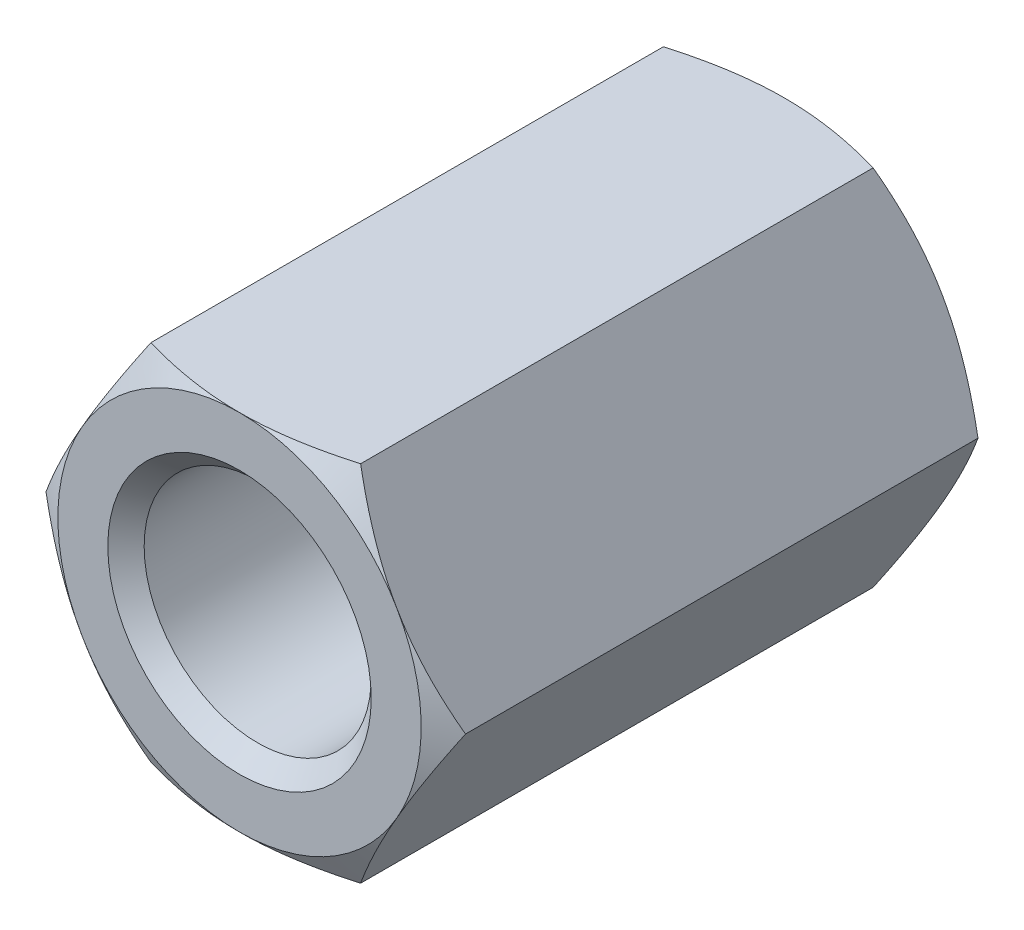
ISO-10303-21;
HEADER;
FILE_DESCRIPTION(('STEP AP214'),'2;1');
FILE_NAME('part.step','',(''),(''),'','','');
FILE_SCHEMA(('AUTOMOTIVE_DESIGN { 1 0 10303 214 1 1 1 1 }'));
ENDSEC;
DATA;
#1=APPLICATION_CONTEXT('core data for automotive mechanical design processes');
#2=APPLICATION_PROTOCOL_DEFINITION('international standard','automotive_design',2000,#1);
#3=PRODUCT_CONTEXT('',#1,'mechanical');
#4=PRODUCT('Part','Part','',(#3));
#5=PRODUCT_RELATED_PRODUCT_CATEGORY('part','',(#4));
#6=PRODUCT_DEFINITION_FORMATION('','',#4);
#7=PRODUCT_DEFINITION_CONTEXT('part definition',#1,'design');
#8=PRODUCT_DEFINITION('design','',#6,#7);
#9=PRODUCT_DEFINITION_SHAPE('','',#8);
#10=(LENGTH_UNIT() NAMED_UNIT(*) SI_UNIT(.MILLI.,.METRE.));
#11=(NAMED_UNIT(*) PLANE_ANGLE_UNIT() SI_UNIT($,.RADIAN.));
#12=(NAMED_UNIT(*) SI_UNIT($,.STERADIAN.) SOLID_ANGLE_UNIT());
#13=UNCERTAINTY_MEASURE_WITH_UNIT(LENGTH_MEASURE(1.E-05),#10,'distance_accuracy_value','');
#14=(GEOMETRIC_REPRESENTATION_CONTEXT(3) GLOBAL_UNCERTAINTY_ASSIGNED_CONTEXT((#13)) GLOBAL_UNIT_ASSIGNED_CONTEXT((#10,
#11,#12)) REPRESENTATION_CONTEXT('',''));
#15=CARTESIAN_POINT('',(0.,0.,0.));
#16=DIRECTION('',(0.,0.,1.));
#17=DIRECTION('',(1.,0.,0.));
#18=AXIS2_PLACEMENT_3D('',#15,#16,#17);
#19=CARTESIAN_POINT('',(4.61880215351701,0.,-6.));
#20=DIRECTION('',(0.866025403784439,0.5,0.));
#21=DIRECTION('',(-0.5,0.866025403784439,0.));
#22=AXIS2_PLACEMENT_3D('',#19,#20,#21);
#23=PLANE('',#22);
#24=CARTESIAN_POINT('',(4.61891762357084,-0.000199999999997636,5.64266774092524));
#25=CARTESIAN_POINT('',(4.5174314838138,0.17557915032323,5.70128212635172));
#26=CARTESIAN_POINT('',(4.41506932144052,0.352875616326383,5.75458967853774));
#27=CARTESIAN_POINT('',(4.20857250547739,0.710538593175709,5.8476383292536));
#28=CARTESIAN_POINT('',(4.10443418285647,0.890911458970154,5.8873465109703));
#29=CARTESIAN_POINT('',(3.89744813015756,1.24942181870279,5.94915778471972));
#30=CARTESIAN_POINT('',(3.79463224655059,1.42750415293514,5.97167226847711));
#31=CARTESIAN_POINT('',(3.58851671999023,1.78450671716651,5.99854937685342));
#32=CARTESIAN_POINT('',(3.48521782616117,1.9634256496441,6.00293425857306));
#33=CARTESIAN_POINT('',(3.29219970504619,2.29774284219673,5.99380992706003));
#34=CARTESIAN_POINT('',(3.20245157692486,2.45319115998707,5.98254104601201));
#35=CARTESIAN_POINT('',(3.02354002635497,2.76307505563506,5.94682600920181));
#36=CARTESIAN_POINT('',(2.93437722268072,2.91750956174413,5.92236765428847));
#37=CARTESIAN_POINT('',(2.75509682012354,3.22803232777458,5.86122393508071));
#38=CARTESIAN_POINT('',(2.6650019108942,3.3840812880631,5.82427939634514));
#39=CARTESIAN_POINT('',(2.48615580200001,3.69385183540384,5.74042992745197));
#40=CARTESIAN_POINT('',(2.39740231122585,3.84757739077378,5.69354469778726));
#41=CARTESIAN_POINT('',(2.30928560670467,4.0002,5.64266774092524));
#42=B_SPLINE_CURVE_WITH_KNOTS('',3,(#24,#25,#26,#27,#28,#29,#30,#31,#32,#33,#34,#35,#36,#37,#38,
#39,#40,#41),.UNSPECIFIED.,.F.,.F.,(4,2,2,2,2,2,2,2,4),(0.,0.634047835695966,1.26961969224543,
1.88946157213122,2.50854226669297,3.04757825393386,3.58711366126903,4.13861653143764,
4.68903648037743),.UNSPECIFIED.);
#43=CARTESIAN_POINT('',(4.61880215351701,0.,5.64273441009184));
#44=VERTEX_POINT('',#43);
#45=CARTESIAN_POINT('',(3.46410161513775,2.,6.));
#46=VERTEX_POINT('',#45);
#47=EDGE_CURVE('E127',#44,#46,#42,.T.);
#48=ORIENTED_EDGE('',*,*,#47,.F.);
#49=DIRECTION('',(0.,0.,1.));
#50=VECTOR('',#49,1.);
#51=CARTESIAN_POINT('',(4.61880215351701,0.,-6.));
#52=LINE('',#51,#50);
#53=CARTESIAN_POINT('',(4.61880215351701,0.,-5.64273441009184));
#54=VERTEX_POINT('',#53);
#55=EDGE_CURVE('E595',#54,#44,#52,.T.);
#56=ORIENTED_EDGE('',*,*,#55,.F.);
#57=CARTESIAN_POINT('',(4.61891762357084,-0.000199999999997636,-5.64266774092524));
#58=CARTESIAN_POINT('',(4.5174314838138,0.17557915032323,-5.70128212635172));
#59=CARTESIAN_POINT('',(4.41506932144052,0.352875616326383,-5.75458967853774));
#60=CARTESIAN_POINT('',(4.20857250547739,0.710538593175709,-5.8476383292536));
#61=CARTESIAN_POINT('',(4.10443418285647,0.890911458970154,-5.8873465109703));
#62=CARTESIAN_POINT('',(3.89744813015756,1.24942181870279,-5.94915778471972));
#63=CARTESIAN_POINT('',(3.79463224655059,1.42750415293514,-5.97167226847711));
#64=CARTESIAN_POINT('',(3.58851671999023,1.78450671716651,-5.99854937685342));
#65=CARTESIAN_POINT('',(3.48521782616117,1.9634256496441,-6.00293425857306));
#66=CARTESIAN_POINT('',(3.29219970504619,2.29774284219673,-5.99380992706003));
#67=CARTESIAN_POINT('',(3.20245157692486,2.45319115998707,-5.98254104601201));
#68=CARTESIAN_POINT('',(3.02354002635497,2.76307505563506,-5.94682600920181));
#69=CARTESIAN_POINT('',(2.93437722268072,2.91750956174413,-5.92236765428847));
#70=CARTESIAN_POINT('',(2.75509682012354,3.22803232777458,-5.86122393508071));
#71=CARTESIAN_POINT('',(2.6650019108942,3.3840812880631,-5.82427939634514));
#72=CARTESIAN_POINT('',(2.48615580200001,3.69385183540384,-5.74042992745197));
#73=CARTESIAN_POINT('',(2.39740231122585,3.84757739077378,-5.69354469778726));
#74=CARTESIAN_POINT('',(2.30928560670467,4.0002,-5.64266774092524));
#75=B_SPLINE_CURVE_WITH_KNOTS('',3,(#57,#58,#59,#60,#61,#62,#63,#64,#65,#66,#67,#68,#69,#70,#71,
#72,#73,#74),.UNSPECIFIED.,.F.,.F.,(4,2,2,2,2,2,2,2,4),(0.,0.634047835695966,1.26961969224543,
1.88946157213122,2.50854226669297,3.04757825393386,3.58711366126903,4.13861653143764,
4.68903648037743),.UNSPECIFIED.);
#76=CARTESIAN_POINT('',(3.46410161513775,2.,-6.));
#77=VERTEX_POINT('',#76);
#78=EDGE_CURVE('E627',#54,#77,#75,.T.);
#79=ORIENTED_EDGE('',*,*,#78,.T.);
#80=CARTESIAN_POINT('',(2.3094010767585,4.,-5.64273441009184));
#81=VERTEX_POINT('',#80);
#82=EDGE_CURVE('E268',#77,#81,#75,.T.);
#83=ORIENTED_EDGE('',*,*,#82,.T.);
#84=DIRECTION('',(0.,0.,1.));
#85=VECTOR('',#84,1.);
#86=CARTESIAN_POINT('',(2.3094010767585,4.,-6.));
#87=LINE('',#86,#85);
#88=CARTESIAN_POINT('',(2.3094010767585,4.,5.64273441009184));
#89=VERTEX_POINT('',#88);
#90=EDGE_CURVE('E159',#81,#89,#87,.T.);
#91=ORIENTED_EDGE('',*,*,#90,.T.);
#92=EDGE_CURVE('E140',#46,#89,#42,.T.);
#93=ORIENTED_EDGE('',*,*,#92,.F.);
#94=EDGE_LOOP('',(#48,#56,#79,#83,#91,#93));
#95=FACE_BOUND('',#94,.T.);
#96=ADVANCED_FACE('F41',(#95),#23,.T.);
#97=CARTESIAN_POINT('',(2.3094010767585,-4.,-6.));
#98=DIRECTION('',(0.866025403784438,-0.5,0.));
#99=DIRECTION('',(0.5,0.866025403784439,0.));
#100=AXIS2_PLACEMENT_3D('',#97,#98,#99);
#101=PLANE('',#100);
#102=CARTESIAN_POINT('',(2.30928560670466,-4.0002,5.64266774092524));
#103=CARTESIAN_POINT('',(2.4107717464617,-3.82442084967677,5.70128212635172));
#104=CARTESIAN_POINT('',(2.51313390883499,-3.64712438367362,5.75458967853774));
#105=CARTESIAN_POINT('',(2.71963072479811,-3.28946140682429,5.8476383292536));
#106=CARTESIAN_POINT('',(2.82376904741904,-3.10908854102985,5.8873465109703));
#107=CARTESIAN_POINT('',(3.03075510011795,-2.75057818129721,5.94915778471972));
#108=CARTESIAN_POINT('',(3.13357098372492,-2.57249584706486,5.97167226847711));
#109=CARTESIAN_POINT('',(3.33968651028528,-2.21549328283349,5.99854937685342));
#110=CARTESIAN_POINT('',(3.44298540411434,-2.0365743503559,6.00293425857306));
#111=CARTESIAN_POINT('',(3.63600352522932,-1.70225715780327,5.99380992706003));
#112=CARTESIAN_POINT('',(3.72575165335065,-1.54680884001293,5.98254104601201));
#113=CARTESIAN_POINT('',(3.90466320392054,-1.23692494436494,5.94682600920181));
#114=CARTESIAN_POINT('',(3.99382600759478,-1.08249043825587,5.92236765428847));
#115=CARTESIAN_POINT('',(4.17310641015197,-0.77196767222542,5.86122393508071));
#116=CARTESIAN_POINT('',(4.26320131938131,-0.615918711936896,5.82427939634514));
#117=CARTESIAN_POINT('',(4.4420474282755,-0.306148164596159,5.74042992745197));
#118=CARTESIAN_POINT('',(4.53080091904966,-0.152422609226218,5.69354469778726));
#119=CARTESIAN_POINT('',(4.61891762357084,0.000200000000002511,5.64266774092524));
#120=B_SPLINE_CURVE_WITH_KNOTS('',3,(#102,#103,#104,#105,#106,#107,#108,#109,#110,#111,#112,
#113,#114,#115,#116,#117,#118,#119),.UNSPECIFIED.,.F.,.F.,(4,2,2,2,2,2,2,2,4),(0.,
0.634047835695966,1.26961969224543,1.88946157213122,2.50854226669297,3.04757825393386,
3.58711366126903,4.13861653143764,4.68903648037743),.UNSPECIFIED.);
#121=CARTESIAN_POINT('',(2.3094010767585,-4.,5.64273441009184));
#122=VERTEX_POINT('',#121);
#123=CARTESIAN_POINT('',(3.46410161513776,-2.,6.));
#124=VERTEX_POINT('',#123);
#125=EDGE_CURVE('E534',#122,#124,#120,.T.);
#126=ORIENTED_EDGE('',*,*,#125,.F.);
#127=DIRECTION('',(0.,0.,1.));
#128=VECTOR('',#127,1.);
#129=CARTESIAN_POINT('',(2.3094010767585,-4.,-6.));
#130=LINE('',#129,#128);
#131=CARTESIAN_POINT('',(2.3094010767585,-4.,-5.64273441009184));
#132=VERTEX_POINT('',#131);
#133=EDGE_CURVE('E281',#132,#122,#130,.T.);
#134=ORIENTED_EDGE('',*,*,#133,.F.);
#135=CARTESIAN_POINT('',(2.30928560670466,-4.0002,-5.64266774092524));
#136=CARTESIAN_POINT('',(2.4107717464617,-3.82442084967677,-5.70128212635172));
#137=CARTESIAN_POINT('',(2.51313390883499,-3.64712438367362,-5.75458967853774));
#138=CARTESIAN_POINT('',(2.71963072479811,-3.28946140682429,-5.8476383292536));
#139=CARTESIAN_POINT('',(2.82376904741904,-3.10908854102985,-5.8873465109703));
#140=CARTESIAN_POINT('',(3.03075510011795,-2.75057818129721,-5.94915778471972));
#141=CARTESIAN_POINT('',(3.13357098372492,-2.57249584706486,-5.97167226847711));
#142=CARTESIAN_POINT('',(3.33968651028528,-2.21549328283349,-5.99854937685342));
#143=CARTESIAN_POINT('',(3.44298540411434,-2.0365743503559,-6.00293425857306));
#144=CARTESIAN_POINT('',(3.63600352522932,-1.70225715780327,-5.99380992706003));
#145=CARTESIAN_POINT('',(3.72575165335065,-1.54680884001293,-5.98254104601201));
#146=CARTESIAN_POINT('',(3.90466320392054,-1.23692494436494,-5.94682600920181));
#147=CARTESIAN_POINT('',(3.99382600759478,-1.08249043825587,-5.92236765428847));
#148=CARTESIAN_POINT('',(4.17310641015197,-0.77196767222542,-5.86122393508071));
#149=CARTESIAN_POINT('',(4.26320131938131,-0.615918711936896,-5.82427939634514));
#150=CARTESIAN_POINT('',(4.4420474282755,-0.306148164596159,-5.74042992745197));
#151=CARTESIAN_POINT('',(4.53080091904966,-0.152422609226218,-5.69354469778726));
#152=CARTESIAN_POINT('',(4.61891762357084,0.000200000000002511,-5.64266774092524));
#153=B_SPLINE_CURVE_WITH_KNOTS('',3,(#135,#136,#137,#138,#139,#140,#141,#142,#143,#144,#145,
#146,#147,#148,#149,#150,#151,#152),.UNSPECIFIED.,.F.,.F.,(4,2,2,2,2,2,2,2,4),(0.,
0.634047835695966,1.26961969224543,1.88946157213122,2.50854226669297,3.04757825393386,
3.58711366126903,4.13861653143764,4.68903648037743),.UNSPECIFIED.);
#154=CARTESIAN_POINT('',(3.46410161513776,-2.,-6.));
#155=VERTEX_POINT('',#154);
#156=EDGE_CURVE('E603',#132,#155,#153,.T.);
#157=ORIENTED_EDGE('',*,*,#156,.T.);
#158=EDGE_CURVE('E282',#155,#54,#153,.T.);
#159=ORIENTED_EDGE('',*,*,#158,.T.);
#160=ORIENTED_EDGE('',*,*,#55,.T.);
#161=EDGE_CURVE('E132',#124,#44,#120,.T.);
#162=ORIENTED_EDGE('',*,*,#161,.F.);
#163=EDGE_LOOP('',(#126,#134,#157,#159,#160,#162));
#164=FACE_BOUND('',#163,.T.);
#165=ADVANCED_FACE('F253',(#164),#101,.T.);
#166=CARTESIAN_POINT('',(-2.3094010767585,-4.,-6.));
#167=DIRECTION('',(0.,-1.,0.));
#168=DIRECTION('',(0.,0.,-1.));
#169=AXIS2_PLACEMENT_3D('',#166,#167,#168);
#170=PLANE('',#169);
#171=CARTESIAN_POINT('',(-12.6404258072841,-4.,0.65476490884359));
#172=CARTESIAN_POINT('',(-12.3609594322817,-4.,0.80858632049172));
#173=CARTESIAN_POINT('',(-12.0813045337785,-4.,0.96206660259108));
#174=CARTESIAN_POINT('',(-11.5215169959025,-4.,1.26816156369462));
#175=CARTESIAN_POINT('',(-11.2413843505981,-4.,1.42077623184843));
#176=CARTESIAN_POINT('',(-10.6804015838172,-4.,1.72503196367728));
#177=CARTESIAN_POINT('',(-10.3995511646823,-4.,1.87667247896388));
#178=CARTESIAN_POINT('',(-9.83714580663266,-4.,2.17863886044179));
#179=CARTESIAN_POINT('',(-9.555590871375,-4.,2.32896473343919));
#180=CARTESIAN_POINT('',(-8.9862954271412,-4.,2.6307702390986));
#181=CARTESIAN_POINT('',(-8.69853819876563,-4.,2.78221837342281));
#182=CARTESIAN_POINT('',(-8.12186359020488,-4.,3.08288803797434));
#183=CARTESIAN_POINT('',(-7.83294621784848,-4.,3.23210958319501));
#184=CARTESIAN_POINT('',(-7.25367551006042,-4.,3.52758248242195));
#185=CARTESIAN_POINT('',(-6.96332251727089,-4.,3.6738345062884));
#186=CARTESIAN_POINT('',(-6.38065370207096,-4.,3.96236035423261));
#187=CARTESIAN_POINT('',(-6.08833794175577,-4.,4.10463430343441));
#188=CARTESIAN_POINT('',(-5.49518784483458,-4.,4.38647747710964));
#189=CARTESIAN_POINT('',(-5.19430016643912,-4.,4.52593542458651));
#190=CARTESIAN_POINT('',(-4.74013447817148,-4.,4.72890873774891));
#191=CARTESIAN_POINT('',(-4.5882500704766,-4.,4.79554063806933));
#192=CARTESIAN_POINT('',(-4.28339108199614,-4.,4.92625693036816));
#193=CARTESIAN_POINT('',(-4.13041653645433,-4.,4.9903414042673));
#194=CARTESIAN_POINT('',(-3.82367638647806,-4.,5.11520262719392));
#195=CARTESIAN_POINT('',(-3.66991475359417,-4.,5.17598909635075));
#196=CARTESIAN_POINT('',(-3.36092720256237,-4.,5.2937551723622));
#197=CARTESIAN_POINT('',(-3.2057012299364,-4.,5.35073463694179));
#198=CARTESIAN_POINT('',(-2.89363286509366,-4.,5.45997326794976));
#199=CARTESIAN_POINT('',(-2.73679093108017,-4.,5.5122337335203));
#200=CARTESIAN_POINT('',(-2.42129724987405,-4.,5.61093761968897));
#201=CARTESIAN_POINT('',(-2.26264570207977,-4.,5.65738167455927));
#202=CARTESIAN_POINT('',(-1.88387963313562,-4.,5.75914903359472));
#203=CARTESIAN_POINT('',(-1.66290033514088,-4.,5.81132807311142));
#204=CARTESIAN_POINT('',(-1.21751447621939,-4.,5.89840800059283));
#205=CARTESIAN_POINT('',(-0.993109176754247,-4.,5.93331509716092));
#206=CARTESIAN_POINT('',(-0.655543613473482,-4.,5.97005927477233));
#207=CARTESIAN_POINT('',(-0.543206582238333,-4.,5.97969871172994));
#208=CARTESIAN_POINT('',(-0.318193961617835,-4.,5.99360343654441));
#209=CARTESIAN_POINT('',(-0.205518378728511,-4.,5.99786882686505));
#210=CARTESIAN_POINT('',(0.0198964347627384,-4.,6.00088803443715));
#211=CARTESIAN_POINT('',(0.132635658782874,-4.,5.99964234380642));
#212=CARTESIAN_POINT('',(0.357932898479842,-4.,5.99168182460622));
#213=CARTESIAN_POINT('',(0.470490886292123,-4.,5.9849662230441));
#214=CARTESIAN_POINT('',(0.724775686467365,-4.,5.96379631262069));
#215=CARTESIAN_POINT('',(0.866373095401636,-4.,5.9477691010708));
#216=CARTESIAN_POINT('',(1.14846756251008,-4.,5.90799540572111));
#217=CARTESIAN_POINT('',(1.28896450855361,-4.,5.88424814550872));
#218=CARTESIAN_POINT('',(1.70869612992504,-4.,5.80273394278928));
#219=CARTESIAN_POINT('',(1.98596294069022,-4.,5.73471436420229));
#220=CARTESIAN_POINT('',(2.40036397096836,-4.,5.61701301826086));
#221=CARTESIAN_POINT('',(2.5397017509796,-4.,5.57463667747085));
#222=CARTESIAN_POINT('',(2.81691508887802,-4.,5.48558820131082));
#223=CARTESIAN_POINT('',(2.9547915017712,-4.,5.43891875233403));
#224=CARTESIAN_POINT('',(3.22924871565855,-4.,5.34200840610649));
#225=CARTESIAN_POINT('',(3.36582970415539,-4.,5.29176803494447));
#226=CARTESIAN_POINT('',(3.63788074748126,-4.,5.18830569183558));
#227=CARTESIAN_POINT('',(3.7733506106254,-4.,5.13508321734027));
#228=CARTESIAN_POINT('',(4.10642901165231,-4.,5.00069335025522));
#229=CARTESIAN_POINT('',(4.30346128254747,-4.,4.9181000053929));
#230=CARTESIAN_POINT('',(4.69576438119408,-4.,4.74881840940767));
#231=CARTESIAN_POINT('',(4.8910350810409,-4.,4.66212986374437));
#232=CARTESIAN_POINT('',(5.28015751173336,-4.,4.48554656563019));
#233=CARTESIAN_POINT('',(5.47400899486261,-4.,4.39565126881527));
#234=CARTESIAN_POINT('',(5.86052127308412,-4.,4.21333240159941));
#235=CARTESIAN_POINT('',(6.05318204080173,-4.,4.12090877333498));
#236=CARTESIAN_POINT('',(6.6301600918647,-4.,3.84040917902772));
#237=CARTESIAN_POINT('',(7.01301014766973,-4.,3.64931775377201));
#238=CARTESIAN_POINT('',(7.77595708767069,-4.,3.26186622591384));
#239=CARTESIAN_POINT('',(8.15605430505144,-4.,3.06550677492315));
#240=CARTESIAN_POINT('',(8.88003989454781,-4.,2.6870129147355));
#241=CARTESIAN_POINT('',(9.22409522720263,-4.,2.50519731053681));
#242=CARTESIAN_POINT('',(9.9110102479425,-4.,2.13929537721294));
#243=CARTESIAN_POINT('',(10.2538698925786,-4.,1.95520896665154));
#244=CARTESIAN_POINT('',(10.9377648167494,-4.,1.58580818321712));
#245=CARTESIAN_POINT('',(11.2788025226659,-4.,1.4004982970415));
#246=CARTESIAN_POINT('',(11.9601262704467,-4.,1.02854450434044));
#247=CARTESIAN_POINT('',(12.3004123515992,-4.,0.841900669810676));
#248=CARTESIAN_POINT('',(12.6404258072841,-4.,0.654764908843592));
#249=B_SPLINE_CURVE_WITH_KNOTS('',3,(#171,#172,#173,#174,#175,#176,#177,#178,#179,#180,#181,
#182,#183,#184,#185,#186,#187,#188,#189,#190,#191,#192,#193,#194,#195,#196,#197,#198,#199,#200,
#201,#202,#203,#204,#205,#206,#207,#208,#209,#210,#211,#212,#213,#214,#215,#216,#217,#218,#219,
#220,#221,#222,#223,#224,#225,#226,#227,#228,#229,#230,#231,#232,#233,#234,#235,#236,#237,#238,
#239,#240,#241,#242,#243,#244,#245,#246,#247,#248),.UNSPECIFIED.,.F.,.F.,(4,2,2,2,2,2,2,2,2,2,2,
2,2,2,2,2,2,2,2,2,2,2,2,2,2,2,2,2,2,2,2,2,2,2,2,2,2,2,4),(0.,0.957007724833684,1.91402741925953,
2.87154547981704,3.82905858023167,4.8045852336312,5.78010531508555,6.75540283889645,
7.73066965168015,8.72547348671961,9.22302786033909,9.7205662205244,10.2165481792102,
10.7125486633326,11.2084121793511,11.7042215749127,12.3848621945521,13.0652579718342,
13.4033972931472,13.7415301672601,14.07963284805,14.4177833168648,14.8450390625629,
15.2723377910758,16.1275610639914,16.5644434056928,17.0010542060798,17.4376008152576,
17.8742212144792,18.515085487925,19.1559959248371,19.797015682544,20.438050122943,
21.7216478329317,23.0050874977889,24.172500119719,25.3399547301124,26.5043475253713,
27.6686779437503),.UNSPECIFIED.);
#250=CARTESIAN_POINT('',(-2.3094010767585,-4.,5.64273441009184));
#251=VERTEX_POINT('',#250);
#252=CARTESIAN_POINT('',(0.,-4.,6.));
#253=VERTEX_POINT('',#252);
#254=EDGE_CURVE('E531',#251,#253,#249,.T.);
#255=ORIENTED_EDGE('',*,*,#254,.F.);
#256=DIRECTION('',(0.,0.,1.));
#257=VECTOR('',#256,1.);
#258=CARTESIAN_POINT('',(-2.3094010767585,-4.,-6.));
#259=LINE('',#258,#257);
#260=CARTESIAN_POINT('',(-2.3094010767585,-4.,-5.64273441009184));
#261=VERTEX_POINT('',#260);
#262=EDGE_CURVE('E583',#261,#251,#259,.T.);
#263=ORIENTED_EDGE('',*,*,#262,.F.);
#264=CARTESIAN_POINT('',(-9.20954650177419,-4.,-2.51239763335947));
#265=CARTESIAN_POINT('',(-8.99996160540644,-4.,-2.6233730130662));
#266=CARTESIAN_POINT('',(-8.7901362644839,-4.,-2.73389739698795));
#267=CARTESIAN_POINT('',(-8.36988903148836,-4.,-2.95381045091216));
#268=CARTESIAN_POINT('',(-8.15946713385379,-4.,-3.06319911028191));
#269=CARTESIAN_POINT('',(-7.73766371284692,-4.,-3.28073452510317));
#270=CARTESIAN_POINT('',(-7.52628134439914,-4.,-3.38887964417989));
#271=CARTESIAN_POINT('',(-7.10265211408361,-4.,-3.6034712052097));
#272=CARTESIAN_POINT('',(-6.89040524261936,-4.,-3.70991762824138));
#273=CARTESIAN_POINT('',(-6.45325708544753,-4.,-3.92643335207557));
#274=CARTESIAN_POINT('',(-6.22829678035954,-4.,-4.03638375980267));
#275=CARTESIAN_POINT('',(-5.77692279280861,-4.,-4.25324682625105));
#276=CARTESIAN_POINT('',(-5.55050916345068,-4.,-4.36015959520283));
#277=CARTESIAN_POINT('',(-5.09596404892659,-4.,-4.5699627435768));
#278=CARTESIAN_POINT('',(-4.86783354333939,-4.,-4.67285523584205));
#279=CARTESIAN_POINT('',(-4.40921468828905,-4.,-4.87337963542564));
#280=CARTESIAN_POINT('',(-4.17872594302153,-4.,-4.9710106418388));
#281=CARTESIAN_POINT('',(-3.69446468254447,-4.,-5.16738746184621));
#282=CARTESIAN_POINT('',(-3.44042380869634,-4.,-5.26547932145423));
#283=CARTESIAN_POINT('',(-2.92809810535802,-4.,-5.44970610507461));
#284=CARTESIAN_POINT('',(-2.66981494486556,-4.,-5.53584561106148));
#285=CARTESIAN_POINT('',(-2.15306355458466,-4.,-5.68974681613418));
#286=CARTESIAN_POINT('',(-1.89469451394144,-4.,-5.75783024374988));
#287=CARTESIAN_POINT('',(-1.50352927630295,-4.,-5.84322641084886));
#288=CARTESIAN_POINT('',(-1.37255212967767,-4.,-5.8689019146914));
#289=CARTESIAN_POINT('',(-1.10952089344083,-4.,-5.91390029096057));
#290=CARTESIAN_POINT('',(-0.977467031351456,-4.,-5.93322447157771));
#291=CARTESIAN_POINT('',(-0.733112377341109,-4.,-5.96238395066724));
#292=CARTESIAN_POINT('',(-0.620931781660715,-4.,-5.9732272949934));
#293=CARTESIAN_POINT('',(-0.396193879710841,-4.,-5.98959144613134));
#294=CARTESIAN_POINT('',(-0.283636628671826,-4.,-5.99511300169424));
#295=CARTESIAN_POINT('',(-0.0584081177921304,-4.,-6.00066724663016));
#296=CARTESIAN_POINT('',(0.0542631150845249,-4.,-6.00070102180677));
#297=CARTESIAN_POINT('',(0.279473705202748,-4.,-5.9952816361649));
#298=CARTESIAN_POINT('',(0.392013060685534,-4.,-5.98982840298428));
#299=CARTESIAN_POINT('',(0.618745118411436,-4.,-5.97345272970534));
#300=CARTESIAN_POINT('',(0.732930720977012,-4.,-5.96243274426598));
#301=CARTESIAN_POINT('',(0.960682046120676,-4.,-5.93519991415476));
#302=CARTESIAN_POINT('',(1.07424773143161,-4.,-5.9189867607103));
#303=CARTESIAN_POINT('',(1.30061751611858,-4.,-5.88179418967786));
#304=CARTESIAN_POINT('',(1.41342143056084,-4.,-5.86081365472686));
#305=CARTESIAN_POINT('',(1.63813713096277,-4.,-5.81457504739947));
#306=CARTESIAN_POINT('',(1.75004894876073,-4.,-5.78931712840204));
#307=CARTESIAN_POINT('',(2.02981552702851,-4.,-5.72116797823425));
#308=CARTESIAN_POINT('',(2.1970807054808,-4.,-5.67585504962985));
#309=CARTESIAN_POINT('',(2.52956420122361,-4.,-5.57821125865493));
#310=CARTESIAN_POINT('',(2.69478201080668,-4.,-5.52587869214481));
#311=CARTESIAN_POINT('',(3.02347594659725,-4.,-5.41552751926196));
#312=CARTESIAN_POINT('',(3.18695019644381,-4.,-5.35750336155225));
#313=CARTESIAN_POINT('',(3.51220118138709,-4.,-5.23694186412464));
#314=CARTESIAN_POINT('',(3.67397804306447,-4.,-5.1744048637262));
#315=CARTESIAN_POINT('',(3.99688309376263,-4.,-5.04538407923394));
#316=CARTESIAN_POINT('',(4.15800398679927,-4.,-4.9788821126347));
#317=CARTESIAN_POINT('',(4.47899441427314,-4.,-4.84291723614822));
#318=CARTESIAN_POINT('',(4.63886389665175,-4.,-4.77345420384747));
#319=CARTESIAN_POINT('',(5.1167060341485,-4.,-4.56156399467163));
#320=CARTESIAN_POINT('',(5.43309229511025,-4.,-4.41556228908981));
#321=CARTESIAN_POINT('',(6.04183433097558,-4.,-4.1270656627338));
#322=CARTESIAN_POINT('',(6.3343880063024,-4.,-3.98498406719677));
#323=CARTESIAN_POINT('',(6.91753132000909,-4.,-3.69675358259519));
#324=CARTESIAN_POINT('',(7.20812068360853,-4.,-3.55060413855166));
#325=CARTESIAN_POINT('',(7.78452192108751,-4.,-3.25699130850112));
#326=CARTESIAN_POINT('',(8.07035078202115,-4.,-3.10956115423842));
#327=CARTESIAN_POINT('',(8.64077734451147,-4.,-2.81248443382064));
#328=CARTESIAN_POINT('',(8.92537529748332,-4.,-2.66283835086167));
#329=CARTESIAN_POINT('',(9.20954650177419,-4.,-2.51239763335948));
#330=B_SPLINE_CURVE_WITH_KNOTS('',3,(#264,#265,#266,#267,#268,#269,#270,#271,#272,#273,#274,
#275,#276,#277,#278,#279,#280,#281,#282,#283,#284,#285,#286,#287,#288,#289,#290,#291,#292,#293,
#294,#295,#296,#297,#298,#299,#300,#301,#302,#303,#304,#305,#306,#307,#308,#309,#310,#311,#312,
#313,#314,#315,#316,#317,#318,#319,#320,#321,#322,#323,#324,#325,#326,#327,#328,#329),
.UNSPECIFIED.,.F.,.F.,(4,2,2,2,2,2,2,2,2,2,2,2,2,2,2,2,2,2,2,2,2,2,2,2,2,2,2,2,2,2,2,2,4),(0.,
0.711459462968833,1.42292558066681,2.13524004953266,2.84756244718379,3.5987213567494,
4.34985297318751,5.1005843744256,5.85144391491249,6.66819201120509,7.48462613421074,
8.28535063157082,8.68563323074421,9.0858333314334,9.42382667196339,9.76177245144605,
10.0996513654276,10.437534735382,10.7815555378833,11.1255967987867,11.4697187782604,
11.8138284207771,12.3335061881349,12.8533103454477,13.3736266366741,13.8939038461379,
14.4167843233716,14.9396864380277,15.9849079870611,16.9605651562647,17.9363560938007,
18.9011793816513,19.8657952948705),.UNSPECIFIED.);
#331=CARTESIAN_POINT('',(0.,-4.,-6.));
#332=VERTEX_POINT('',#331);
#333=EDGE_CURVE('E593',#261,#332,#330,.T.);
#334=ORIENTED_EDGE('',*,*,#333,.T.);
#335=EDGE_CURVE('E258',#332,#132,#330,.T.);
#336=ORIENTED_EDGE('',*,*,#335,.T.);
#337=ORIENTED_EDGE('',*,*,#133,.T.);
#338=EDGE_CURVE('E138',#253,#122,#249,.T.);
#339=ORIENTED_EDGE('',*,*,#338,.F.);
#340=EDGE_LOOP('',(#255,#263,#334,#336,#337,#339));
#341=FACE_BOUND('',#340,.T.);
#342=ADVANCED_FACE('F290',(#341),#170,.T.);
#343=CARTESIAN_POINT('',(-4.61880215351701,0.,-6.));
#344=DIRECTION('',(-0.866025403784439,-0.5,0.));
#345=DIRECTION('',(0.5,-0.866025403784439,0.));
#346=AXIS2_PLACEMENT_3D('',#343,#344,#345);
#347=PLANE('',#346);
#348=CARTESIAN_POINT('',(-4.61891762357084,0.000199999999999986,5.64266774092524));
#349=CARTESIAN_POINT('',(-4.5174314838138,-0.175579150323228,5.70128212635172));
#350=CARTESIAN_POINT('',(-4.41506932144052,-0.352875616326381,5.75458967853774));
#351=CARTESIAN_POINT('',(-4.20857250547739,-0.710538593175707,5.8476383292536));
#352=CARTESIAN_POINT('',(-4.10443418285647,-0.890911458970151,5.8873465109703));
#353=CARTESIAN_POINT('',(-3.89744813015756,-1.24942181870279,5.94915778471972));
#354=CARTESIAN_POINT('',(-3.79463224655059,-1.42750415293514,5.97167226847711));
#355=CARTESIAN_POINT('',(-3.58851671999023,-1.78450671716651,5.99854937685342));
#356=CARTESIAN_POINT('',(-3.48521782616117,-1.9634256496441,6.00293425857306));
#357=CARTESIAN_POINT('',(-3.29219970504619,-2.29774284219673,5.99380992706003));
#358=CARTESIAN_POINT('',(-3.20245157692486,-2.45319115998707,5.98254104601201));
#359=CARTESIAN_POINT('',(-3.02354002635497,-2.76307505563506,5.94682600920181));
#360=CARTESIAN_POINT('',(-2.93437722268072,-2.91750956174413,5.92236765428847));
#361=CARTESIAN_POINT('',(-2.75509682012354,-3.22803232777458,5.86122393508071));
#362=CARTESIAN_POINT('',(-2.6650019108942,-3.3840812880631,5.82427939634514));
#363=CARTESIAN_POINT('',(-2.48615580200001,-3.69385183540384,5.74042992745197));
#364=CARTESIAN_POINT('',(-2.39740231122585,-3.84757739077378,5.69354469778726));
#365=CARTESIAN_POINT('',(-2.30928560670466,-4.0002,5.64266774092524));
#366=B_SPLINE_CURVE_WITH_KNOTS('',3,(#348,#349,#350,#351,#352,#353,#354,#355,#356,#357,#358,
#359,#360,#361,#362,#363,#364,#365),.UNSPECIFIED.,.F.,.F.,(4,2,2,2,2,2,2,2,4),(0.,
0.634047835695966,1.26961969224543,1.88946157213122,2.50854226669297,3.04757825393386,
3.58711366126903,4.13861653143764,4.68903648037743),.UNSPECIFIED.);
#367=CARTESIAN_POINT('',(-4.61880215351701,0.,5.64273441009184));
#368=VERTEX_POINT('',#367);
#369=CARTESIAN_POINT('',(-3.46410161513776,-2.,6.));
#370=VERTEX_POINT('',#369);
#371=EDGE_CURVE('E175',#368,#370,#366,.T.);
#372=ORIENTED_EDGE('',*,*,#371,.F.);
#373=DIRECTION('',(0.,0.,1.));
#374=VECTOR('',#373,1.);
#375=CARTESIAN_POINT('',(-4.61880215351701,0.,-6.));
#376=LINE('',#375,#374);
#377=CARTESIAN_POINT('',(-4.61880215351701,0.,-5.64273441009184));
#378=VERTEX_POINT('',#377);
#379=EDGE_CURVE('E526',#378,#368,#376,.T.);
#380=ORIENTED_EDGE('',*,*,#379,.F.);
#381=CARTESIAN_POINT('',(-4.61891762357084,0.000199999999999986,-5.64266774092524));
#382=CARTESIAN_POINT('',(-4.5174314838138,-0.175579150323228,-5.70128212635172));
#383=CARTESIAN_POINT('',(-4.41506932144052,-0.352875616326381,-5.75458967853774));
#384=CARTESIAN_POINT('',(-4.20857250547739,-0.710538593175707,-5.8476383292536));
#385=CARTESIAN_POINT('',(-4.10443418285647,-0.890911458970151,-5.8873465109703));
#386=CARTESIAN_POINT('',(-3.89744813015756,-1.24942181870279,-5.94915778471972));
#387=CARTESIAN_POINT('',(-3.79463224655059,-1.42750415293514,-5.97167226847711));
#388=CARTESIAN_POINT('',(-3.58851671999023,-1.78450671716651,-5.99854937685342));
#389=CARTESIAN_POINT('',(-3.48521782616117,-1.9634256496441,-6.00293425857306));
#390=CARTESIAN_POINT('',(-3.29219970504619,-2.29774284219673,-5.99380992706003));
#391=CARTESIAN_POINT('',(-3.20245157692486,-2.45319115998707,-5.98254104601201));
#392=CARTESIAN_POINT('',(-3.02354002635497,-2.76307505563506,-5.94682600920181));
#393=CARTESIAN_POINT('',(-2.93437722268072,-2.91750956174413,-5.92236765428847));
#394=CARTESIAN_POINT('',(-2.75509682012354,-3.22803232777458,-5.86122393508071));
#395=CARTESIAN_POINT('',(-2.6650019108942,-3.3840812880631,-5.82427939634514));
#396=CARTESIAN_POINT('',(-2.48615580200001,-3.69385183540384,-5.74042992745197));
#397=CARTESIAN_POINT('',(-2.39740231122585,-3.84757739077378,-5.69354469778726));
#398=CARTESIAN_POINT('',(-2.30928560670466,-4.0002,-5.64266774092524));
#399=B_SPLINE_CURVE_WITH_KNOTS('',3,(#381,#382,#383,#384,#385,#386,#387,#388,#389,#390,#391,
#392,#393,#394,#395,#396,#397,#398),.UNSPECIFIED.,.F.,.F.,(4,2,2,2,2,2,2,2,4),(0.,
0.634047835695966,1.26961969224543,1.88946157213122,2.50854226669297,3.04757825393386,
3.58711366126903,4.13861653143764,4.68903648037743),.UNSPECIFIED.);
#400=CARTESIAN_POINT('',(-3.46410161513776,-2.,-6.));
#401=VERTEX_POINT('',#400);
#402=EDGE_CURVE('E274',#378,#401,#399,.T.);
#403=ORIENTED_EDGE('',*,*,#402,.T.);
#404=EDGE_CURVE('E280',#401,#261,#399,.T.);
#405=ORIENTED_EDGE('',*,*,#404,.T.);
#406=ORIENTED_EDGE('',*,*,#262,.T.);
#407=EDGE_CURVE('E533',#370,#251,#366,.T.);
#408=ORIENTED_EDGE('',*,*,#407,.F.);
#409=EDGE_LOOP('',(#372,#380,#403,#405,#406,#408));
#410=FACE_BOUND('',#409,.T.);
#411=ADVANCED_FACE('F287',(#410),#347,.T.);
#412=CARTESIAN_POINT('',(-2.3094010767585,4.,-6.));
#413=DIRECTION('',(-0.866025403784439,0.5,0.));
#414=DIRECTION('',(-0.5,-0.866025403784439,0.));
#415=AXIS2_PLACEMENT_3D('',#412,#413,#414);
#416=PLANE('',#415);
#417=CARTESIAN_POINT('',(-2.30928560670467,4.0002,5.64266774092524));
#418=CARTESIAN_POINT('',(-2.41077174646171,3.82442084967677,5.70128212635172));
#419=CARTESIAN_POINT('',(-2.513133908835,3.64712438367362,5.75458967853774));
#420=CARTESIAN_POINT('',(-2.71963072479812,3.28946140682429,5.8476383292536));
#421=CARTESIAN_POINT('',(-2.82376904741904,3.10908854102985,5.8873465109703));
#422=CARTESIAN_POINT('',(-3.03075510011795,2.75057818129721,5.94915778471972));
#423=CARTESIAN_POINT('',(-3.13357098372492,2.57249584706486,5.97167226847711));
#424=CARTESIAN_POINT('',(-3.33968651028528,2.21549328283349,5.99854937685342));
#425=CARTESIAN_POINT('',(-3.44298540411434,2.0365743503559,6.00293425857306));
#426=CARTESIAN_POINT('',(-3.63600352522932,1.70225715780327,5.99380992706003));
#427=CARTESIAN_POINT('',(-3.72575165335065,1.54680884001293,5.98254104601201));
#428=CARTESIAN_POINT('',(-3.90466320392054,1.23692494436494,5.94682600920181));
#429=CARTESIAN_POINT('',(-3.99382600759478,1.08249043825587,5.92236765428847));
#430=CARTESIAN_POINT('',(-4.17310641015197,0.771967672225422,5.86122393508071));
#431=CARTESIAN_POINT('',(-4.26320131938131,0.615918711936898,5.82427939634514));
#432=CARTESIAN_POINT('',(-4.4420474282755,0.306148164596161,5.74042992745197));
#433=CARTESIAN_POINT('',(-4.53080091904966,0.152422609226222,5.69354469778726));
#434=CARTESIAN_POINT('',(-4.61891762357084,-0.000199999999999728,5.64266774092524));
#435=B_SPLINE_CURVE_WITH_KNOTS('',3,(#417,#418,#419,#420,#421,#422,#423,#424,#425,#426,#427,
#428,#429,#430,#431,#432,#433,#434),.UNSPECIFIED.,.F.,.F.,(4,2,2,2,2,2,2,2,4),(0.,
0.634047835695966,1.26961969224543,1.88946157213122,2.50854226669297,3.04757825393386,
3.58711366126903,4.13861653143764,4.68903648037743),.UNSPECIFIED.);
#436=CARTESIAN_POINT('',(-2.3094010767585,4.,5.64273441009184));
#437=VERTEX_POINT('',#436);
#438=CARTESIAN_POINT('',(-3.46410161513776,2.,6.));
#439=VERTEX_POINT('',#438);
#440=EDGE_CURVE('E182',#437,#439,#435,.T.);
#441=ORIENTED_EDGE('',*,*,#440,.F.);
#442=DIRECTION('',(0.,0.,1.));
#443=VECTOR('',#442,1.);
#444=CARTESIAN_POINT('',(-2.3094010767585,4.,-6.));
#445=LINE('',#444,#443);
#446=CARTESIAN_POINT('',(-2.3094010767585,4.,-5.64273441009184));
#447=VERTEX_POINT('',#446);
#448=EDGE_CURVE('E232',#447,#437,#445,.T.);
#449=ORIENTED_EDGE('',*,*,#448,.F.);
#450=CARTESIAN_POINT('',(-2.30928560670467,4.0002,-5.64266774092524));
#451=CARTESIAN_POINT('',(-2.41077174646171,3.82442084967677,-5.70128212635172));
#452=CARTESIAN_POINT('',(-2.513133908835,3.64712438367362,-5.75458967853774));
#453=CARTESIAN_POINT('',(-2.71963072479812,3.28946140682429,-5.8476383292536));
#454=CARTESIAN_POINT('',(-2.82376904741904,3.10908854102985,-5.8873465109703));
#455=CARTESIAN_POINT('',(-3.03075510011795,2.75057818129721,-5.94915778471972));
#456=CARTESIAN_POINT('',(-3.13357098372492,2.57249584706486,-5.97167226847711));
#457=CARTESIAN_POINT('',(-3.33968651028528,2.21549328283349,-5.99854937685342));
#458=CARTESIAN_POINT('',(-3.44298540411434,2.0365743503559,-6.00293425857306));
#459=CARTESIAN_POINT('',(-3.63600352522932,1.70225715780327,-5.99380992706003));
#460=CARTESIAN_POINT('',(-3.72575165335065,1.54680884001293,-5.98254104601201));
#461=CARTESIAN_POINT('',(-3.90466320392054,1.23692494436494,-5.94682600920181));
#462=CARTESIAN_POINT('',(-3.99382600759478,1.08249043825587,-5.92236765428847));
#463=CARTESIAN_POINT('',(-4.17310641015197,0.771967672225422,-5.86122393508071));
#464=CARTESIAN_POINT('',(-4.26320131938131,0.615918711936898,-5.82427939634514));
#465=CARTESIAN_POINT('',(-4.4420474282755,0.306148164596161,-5.74042992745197));
#466=CARTESIAN_POINT('',(-4.53080091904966,0.152422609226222,-5.69354469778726));
#467=CARTESIAN_POINT('',(-4.61891762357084,-0.000199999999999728,-5.64266774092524));
#468=B_SPLINE_CURVE_WITH_KNOTS('',3,(#450,#451,#452,#453,#454,#455,#456,#457,#458,#459,#460,
#461,#462,#463,#464,#465,#466,#467),.UNSPECIFIED.,.F.,.F.,(4,2,2,2,2,2,2,2,4),(0.,
0.634047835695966,1.26961969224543,1.88946157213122,2.50854226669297,3.04757825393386,
3.58711366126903,4.13861653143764,4.68903648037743),.UNSPECIFIED.);
#469=CARTESIAN_POINT('',(-3.46410161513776,2.,-6.));
#470=VERTEX_POINT('',#469);
#471=EDGE_CURVE('E236',#447,#470,#468,.T.);
#472=ORIENTED_EDGE('',*,*,#471,.T.);
#473=EDGE_CURVE('E529',#470,#378,#468,.T.);
#474=ORIENTED_EDGE('',*,*,#473,.T.);
#475=ORIENTED_EDGE('',*,*,#379,.T.);
#476=EDGE_CURVE('E559',#439,#368,#435,.T.);
#477=ORIENTED_EDGE('',*,*,#476,.F.);
#478=EDGE_LOOP('',(#441,#449,#472,#474,#475,#477));
#479=FACE_BOUND('',#478,.T.);
#480=ADVANCED_FACE('F217',(#479),#416,.T.);
#481=CARTESIAN_POINT('',(2.3094010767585,4.,-6.));
#482=DIRECTION('',(0.,1.,0.));
#483=DIRECTION('',(0.,0.,1.));
#484=AXIS2_PLACEMENT_3D('',#481,#482,#483);
#485=PLANE('',#484);
#486=CARTESIAN_POINT('',(12.6404258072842,4.,0.654764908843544));
#487=CARTESIAN_POINT('',(12.3609594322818,4.,0.808586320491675));
#488=CARTESIAN_POINT('',(12.0813045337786,4.,0.962066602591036));
#489=CARTESIAN_POINT('',(11.5215169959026,4.,1.26816156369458));
#490=CARTESIAN_POINT('',(11.2413843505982,4.,1.42077623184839));
#491=CARTESIAN_POINT('',(10.6804015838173,4.,1.72503196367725));
#492=CARTESIAN_POINT('',(10.3995511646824,4.,1.87667247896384));
#493=CARTESIAN_POINT('',(9.83714580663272,4.,2.17863886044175));
#494=CARTESIAN_POINT('',(9.55559087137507,4.,2.32896473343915));
#495=CARTESIAN_POINT('',(8.98629542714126,4.,2.63077023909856));
#496=CARTESIAN_POINT('',(8.69853819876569,4.,2.78221837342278));
#497=CARTESIAN_POINT('',(8.12186359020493,4.,3.08288803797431));
#498=CARTESIAN_POINT('',(7.83294621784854,4.,3.23210958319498));
#499=CARTESIAN_POINT('',(7.25367551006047,4.,3.52758248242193));
#500=CARTESIAN_POINT('',(6.96332251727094,4.,3.67383450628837));
#501=CARTESIAN_POINT('',(6.38065370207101,4.,3.96236035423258));
#502=CARTESIAN_POINT('',(6.08833794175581,4.,4.10463430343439));
#503=CARTESIAN_POINT('',(5.49518784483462,4.,4.38647747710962));
#504=CARTESIAN_POINT('',(5.19430016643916,4.,4.52593542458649));
#505=CARTESIAN_POINT('',(4.74013447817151,4.,4.72890873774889));
#506=CARTESIAN_POINT('',(4.58825007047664,4.,4.79554063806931));
#507=CARTESIAN_POINT('',(4.28339108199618,4.,4.92625693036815));
#508=CARTESIAN_POINT('',(4.13041653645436,4.,4.99034140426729));
#509=CARTESIAN_POINT('',(3.82367638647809,4.,5.11520262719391));
#510=CARTESIAN_POINT('',(3.6699147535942,4.,5.17598909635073));
#511=CARTESIAN_POINT('',(3.3609272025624,4.,5.29375517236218));
#512=CARTESIAN_POINT('',(3.20570122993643,4.,5.35073463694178));
#513=CARTESIAN_POINT('',(2.89363286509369,4.,5.45997326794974));
#514=CARTESIAN_POINT('',(2.7367909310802,4.,5.51223373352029));
#515=CARTESIAN_POINT('',(2.42129724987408,4.,5.61093761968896));
#516=CARTESIAN_POINT('',(2.2626457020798,4.,5.65738167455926));
#517=CARTESIAN_POINT('',(1.88387963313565,4.,5.75914903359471));
#518=CARTESIAN_POINT('',(1.66290033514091,4.,5.81132807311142));
#519=CARTESIAN_POINT('',(1.21751447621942,4.,5.89840800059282));
#520=CARTESIAN_POINT('',(0.993109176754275,4.,5.93331509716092));
#521=CARTESIAN_POINT('',(0.655543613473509,4.,5.97005927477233));
#522=CARTESIAN_POINT('',(0.543206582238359,4.,5.97969871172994));
#523=CARTESIAN_POINT('',(0.318193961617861,4.,5.99360343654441));
#524=CARTESIAN_POINT('',(0.205518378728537,4.,5.99786882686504));
#525=CARTESIAN_POINT('',(-0.0198964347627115,4.,6.00088803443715));
#526=CARTESIAN_POINT('',(-0.132635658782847,4.,5.99964234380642));
#527=CARTESIAN_POINT('',(-0.357932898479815,4.,5.99168182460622));
#528=CARTESIAN_POINT('',(-0.470490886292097,4.,5.98496622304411));
#529=CARTESIAN_POINT('',(-0.72477568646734,4.,5.96379631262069));
#530=CARTESIAN_POINT('',(-0.866373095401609,4.,5.9477691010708));
#531=CARTESIAN_POINT('',(-1.14846756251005,4.,5.90799540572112));
#532=CARTESIAN_POINT('',(-1.28896450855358,4.,5.88424814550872));
#533=CARTESIAN_POINT('',(-1.70869612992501,4.,5.80273394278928));
#534=CARTESIAN_POINT('',(-1.98596294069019,4.,5.7347143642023));
#535=CARTESIAN_POINT('',(-2.40036397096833,4.,5.61701301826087));
#536=CARTESIAN_POINT('',(-2.53970175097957,4.,5.57463667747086));
#537=CARTESIAN_POINT('',(-2.81691508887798,4.,5.48558820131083));
#538=CARTESIAN_POINT('',(-2.95479150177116,4.,5.43891875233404));
#539=CARTESIAN_POINT('',(-3.22924871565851,4.,5.3420084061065));
#540=CARTESIAN_POINT('',(-3.36582970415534,4.,5.29176803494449));
#541=CARTESIAN_POINT('',(-3.63788074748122,4.,5.18830569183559));
#542=CARTESIAN_POINT('',(-3.77335061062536,4.,5.13508321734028));
#543=CARTESIAN_POINT('',(-4.10642901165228,4.,5.00069335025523));
#544=CARTESIAN_POINT('',(-4.30346128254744,4.,4.91810000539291));
#545=CARTESIAN_POINT('',(-4.69576438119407,4.,4.74881840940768));
#546=CARTESIAN_POINT('',(-4.89103508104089,4.,4.66212986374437));
#547=CARTESIAN_POINT('',(-5.28015751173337,4.,4.48554656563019));
#548=CARTESIAN_POINT('',(-5.47400899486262,4.,4.39565126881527));
#549=CARTESIAN_POINT('',(-5.86052127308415,4.,4.21333240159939));
#550=CARTESIAN_POINT('',(-6.05318204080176,4.,4.12090877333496));
#551=CARTESIAN_POINT('',(-6.63016009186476,4.,3.84040917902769));
#552=CARTESIAN_POINT('',(-7.01301014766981,4.,3.64931775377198));
#553=CARTESIAN_POINT('',(-7.7759570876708,4.,3.26186622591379));
#554=CARTESIAN_POINT('',(-8.15605430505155,4.,3.06550677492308));
#555=CARTESIAN_POINT('',(-8.88003989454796,4.,2.68701291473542));
#556=CARTESIAN_POINT('',(-9.22409522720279,4.,2.50519731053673));
#557=CARTESIAN_POINT('',(-9.91101024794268,4.,2.13929537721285));
#558=CARTESIAN_POINT('',(-10.2538698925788,4.,1.95520896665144));
#559=CARTESIAN_POINT('',(-10.9377648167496,4.,1.585808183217));
#560=CARTESIAN_POINT('',(-11.2788025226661,4.,1.40049829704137));
#561=CARTESIAN_POINT('',(-11.9601262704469,4.,1.0285445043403));
#562=CARTESIAN_POINT('',(-12.3004123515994,4.,0.841900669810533));
#563=CARTESIAN_POINT('',(-12.6404258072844,4.,0.654764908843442));
#564=B_SPLINE_CURVE_WITH_KNOTS('',3,(#486,#487,#488,#489,#490,#491,#492,#493,#494,#495,#496,
#497,#498,#499,#500,#501,#502,#503,#504,#505,#506,#507,#508,#509,#510,#511,#512,#513,#514,#515,
#516,#517,#518,#519,#520,#521,#522,#523,#524,#525,#526,#527,#528,#529,#530,#531,#532,#533,#534,
#535,#536,#537,#538,#539,#540,#541,#542,#543,#544,#545,#546,#547,#548,#549,#550,#551,#552,#553,
#554,#555,#556,#557,#558,#559,#560,#561,#562,#563),.UNSPECIFIED.,.F.,.F.,(4,2,2,2,2,2,2,2,2,2,2,
2,2,2,2,2,2,2,2,2,2,2,2,2,2,2,2,2,2,2,2,2,2,2,2,2,2,2,4),(0.,0.957007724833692,1.91402741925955,
2.87154547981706,3.82905858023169,4.80458523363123,5.78010531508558,6.7554028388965,
7.7306696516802,8.72547348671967,9.22302786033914,9.72056622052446,10.2165481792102,
10.7125486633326,11.2084121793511,11.7042215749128,12.3848621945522,13.0652579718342,
13.4033972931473,13.7415301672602,14.0796328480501,14.4177833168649,14.845039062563,
15.2723377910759,16.1275610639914,16.5644434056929,17.0010542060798,17.4376008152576,
17.8742212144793,18.5150854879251,19.1559959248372,19.7970156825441,20.4380501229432,
21.7216478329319,23.0050874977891,24.1725001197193,25.3399547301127,26.5043475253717,
27.6686779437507),.UNSPECIFIED.);
#565=CARTESIAN_POINT('',(0.,4.,6.));
#566=VERTEX_POINT('',#565);
#567=EDGE_CURVE('E145',#89,#566,#564,.T.);
#568=ORIENTED_EDGE('',*,*,#567,.F.);
#569=ORIENTED_EDGE('',*,*,#90,.F.);
#570=CARTESIAN_POINT('',(9.20954650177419,4.,-2.51239763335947));
#571=CARTESIAN_POINT('',(8.99996160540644,4.,-2.6233730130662));
#572=CARTESIAN_POINT('',(8.79013626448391,4.,-2.73389739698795));
#573=CARTESIAN_POINT('',(8.36988903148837,4.,-2.95381045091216));
#574=CARTESIAN_POINT('',(8.15946713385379,4.,-3.06319911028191));
#575=CARTESIAN_POINT('',(7.73766371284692,4.,-3.28073452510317));
#576=CARTESIAN_POINT('',(7.52628134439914,4.,-3.38887964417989));
#577=CARTESIAN_POINT('',(7.10265211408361,4.,-3.60347120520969));
#578=CARTESIAN_POINT('',(6.89040524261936,4.,-3.70991762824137));
#579=CARTESIAN_POINT('',(6.45325708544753,4.,-3.92643335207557));
#580=CARTESIAN_POINT('',(6.22829678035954,4.,-4.03638375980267));
#581=CARTESIAN_POINT('',(5.77692279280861,4.,-4.25324682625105));
#582=CARTESIAN_POINT('',(5.55050916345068,4.,-4.36015959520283));
#583=CARTESIAN_POINT('',(5.09596404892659,4.,-4.5699627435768));
#584=CARTESIAN_POINT('',(4.86783354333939,4.,-4.67285523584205));
#585=CARTESIAN_POINT('',(4.40921468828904,4.,-4.87337963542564));
#586=CARTESIAN_POINT('',(4.17872594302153,4.,-4.9710106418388));
#587=CARTESIAN_POINT('',(3.69446468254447,4.,-5.1673874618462));
#588=CARTESIAN_POINT('',(3.44042380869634,4.,-5.26547932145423));
#589=CARTESIAN_POINT('',(2.92809810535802,4.,-5.44970610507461));
#590=CARTESIAN_POINT('',(2.66981494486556,4.,-5.53584561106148));
#591=CARTESIAN_POINT('',(2.15306355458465,4.,-5.68974681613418));
#592=CARTESIAN_POINT('',(1.89469451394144,4.,-5.75783024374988));
#593=CARTESIAN_POINT('',(1.50352927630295,4.,-5.84322641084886));
#594=CARTESIAN_POINT('',(1.37255212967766,4.,-5.8689019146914));
#595=CARTESIAN_POINT('',(1.10952089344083,4.,-5.91390029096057));
#596=CARTESIAN_POINT('',(0.977467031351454,4.,-5.93322447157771));
#597=CARTESIAN_POINT('',(0.733112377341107,4.,-5.96238395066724));
#598=CARTESIAN_POINT('',(0.620931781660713,4.,-5.97322729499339));
#599=CARTESIAN_POINT('',(0.396193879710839,4.,-5.98959144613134));
#600=CARTESIAN_POINT('',(0.283636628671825,4.,-5.99511300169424));
#601=CARTESIAN_POINT('',(0.0584081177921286,4.,-6.00066724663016));
#602=CARTESIAN_POINT('',(-0.0542631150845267,4.,-6.00070102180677));
#603=CARTESIAN_POINT('',(-0.279473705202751,4.,-5.9952816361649));
#604=CARTESIAN_POINT('',(-0.392013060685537,4.,-5.98982840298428));
#605=CARTESIAN_POINT('',(-0.61874511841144,4.,-5.97345272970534));
#606=CARTESIAN_POINT('',(-0.732930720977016,4.,-5.96243274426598));
#607=CARTESIAN_POINT('',(-0.960682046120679,4.,-5.93519991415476));
#608=CARTESIAN_POINT('',(-1.07424773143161,4.,-5.9189867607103));
#609=CARTESIAN_POINT('',(-1.30061751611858,4.,-5.88179418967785));
#610=CARTESIAN_POINT('',(-1.41342143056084,4.,-5.86081365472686));
#611=CARTESIAN_POINT('',(-1.63813713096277,4.,-5.81457504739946));
#612=CARTESIAN_POINT('',(-1.75004894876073,4.,-5.78931712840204));
#613=CARTESIAN_POINT('',(-2.02981552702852,4.,-5.72116797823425));
#614=CARTESIAN_POINT('',(-2.19708070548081,4.,-5.67585504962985));
#615=CARTESIAN_POINT('',(-2.52956420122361,4.,-5.57821125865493));
#616=CARTESIAN_POINT('',(-2.69478201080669,4.,-5.52587869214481));
#617=CARTESIAN_POINT('',(-3.02347594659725,4.,-5.41552751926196));
#618=CARTESIAN_POINT('',(-3.18695019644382,4.,-5.35750336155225));
#619=CARTESIAN_POINT('',(-3.51220118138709,4.,-5.23694186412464));
#620=CARTESIAN_POINT('',(-3.67397804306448,4.,-5.17440486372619));
#621=CARTESIAN_POINT('',(-3.99688309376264,4.,-5.04538407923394));
#622=CARTESIAN_POINT('',(-4.15800398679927,4.,-4.9788821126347));
#623=CARTESIAN_POINT('',(-4.47899441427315,4.,-4.84291723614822));
#624=CARTESIAN_POINT('',(-4.63886389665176,4.,-4.77345420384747));
#625=CARTESIAN_POINT('',(-5.11670603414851,4.,-4.56156399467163));
#626=CARTESIAN_POINT('',(-5.43309229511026,4.,-4.4155622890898));
#627=CARTESIAN_POINT('',(-6.04183433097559,4.,-4.1270656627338));
#628=CARTESIAN_POINT('',(-6.3343880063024,4.,-3.98498406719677));
#629=CARTESIAN_POINT('',(-6.9175313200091,4.,-3.69675358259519));
#630=CARTESIAN_POINT('',(-7.20812068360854,4.,-3.55060413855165));
#631=CARTESIAN_POINT('',(-7.78452192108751,4.,-3.25699130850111));
#632=CARTESIAN_POINT('',(-8.07035078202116,4.,-3.10956115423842));
#633=CARTESIAN_POINT('',(-8.64077734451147,4.,-2.81248443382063));
#634=CARTESIAN_POINT('',(-8.92537529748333,4.,-2.66283835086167));
#635=CARTESIAN_POINT('',(-9.2095465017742,4.,-2.51239763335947));
#636=B_SPLINE_CURVE_WITH_KNOTS('',3,(#570,#571,#572,#573,#574,#575,#576,#577,#578,#579,#580,
#581,#582,#583,#584,#585,#586,#587,#588,#589,#590,#591,#592,#593,#594,#595,#596,#597,#598,#599,
#600,#601,#602,#603,#604,#605,#606,#607,#608,#609,#610,#611,#612,#613,#614,#615,#616,#617,#618,
#619,#620,#621,#622,#623,#624,#625,#626,#627,#628,#629,#630,#631,#632,#633,#634,#635),
.UNSPECIFIED.,.F.,.F.,(4,2,2,2,2,2,2,2,2,2,2,2,2,2,2,2,2,2,2,2,2,2,2,2,2,2,2,2,2,2,2,2,4),(0.,
0.711459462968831,1.42292558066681,2.13524004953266,2.84756244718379,3.5987213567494,
4.34985297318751,5.1005843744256,5.85144391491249,6.66819201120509,7.48462613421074,
8.28535063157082,8.68563323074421,9.0858333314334,9.42382667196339,9.76177245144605,
10.0996513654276,10.437534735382,10.7815555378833,11.1255967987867,11.4697187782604,
11.8138284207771,12.3335061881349,12.8533103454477,13.3736266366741,13.8939038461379,
14.4167843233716,14.9396864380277,15.9849079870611,16.9605651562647,17.9363560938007,
18.9011793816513,19.8657952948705),.UNSPECIFIED.);
#637=CARTESIAN_POINT('',(0.,4.,-6.));
#638=VERTEX_POINT('',#637);
#639=EDGE_CURVE('E233',#81,#638,#636,.T.);
#640=ORIENTED_EDGE('',*,*,#639,.T.);
#641=EDGE_CURVE('E222',#638,#447,#636,.T.);
#642=ORIENTED_EDGE('',*,*,#641,.T.);
#643=ORIENTED_EDGE('',*,*,#448,.T.);
#644=EDGE_CURVE('E161',#566,#437,#564,.T.);
#645=ORIENTED_EDGE('',*,*,#644,.F.);
#646=EDGE_LOOP('',(#568,#569,#640,#642,#643,#645));
#647=FACE_BOUND('',#646,.T.);
#648=ADVANCED_FACE('F213',(#647),#485,.T.);
#649=CARTESIAN_POINT('',(0.,0.,-6.));
#650=DIRECTION('',(0.,0.,1.));
#651=DIRECTION('',(-1.,0.,0.));
#652=AXIS2_PLACEMENT_3D('',#649,#650,#651);
#653=CONICAL_SURFACE('',#652,4.,1.0471975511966);
#654=CARTESIAN_POINT('',(0.,0.,-6.));
#655=DIRECTION('',(0.,0.,1.));
#656=DIRECTION('',(1.,0.,0.));
#657=AXIS2_PLACEMENT_3D('',#654,#655,#656);
#658=CIRCLE('',#657,4.);
#659=EDGE_CURVE('E550',#155,#77,#658,.T.);
#660=ORIENTED_EDGE('',*,*,#659,.T.);
#661=ORIENTED_EDGE('',*,*,#78,.F.);
#662=ORIENTED_EDGE('',*,*,#158,.F.);
#663=EDGE_LOOP('',(#660,#661,#662));
#664=FACE_BOUND('',#663,.T.);
#665=ADVANCED_FACE('F216',(#664),#653,.T.);
#666=EDGE_CURVE('E606',#332,#155,#658,.T.);
#667=ORIENTED_EDGE('',*,*,#666,.T.);
#668=ORIENTED_EDGE('',*,*,#156,.F.);
#669=ORIENTED_EDGE('',*,*,#335,.F.);
#670=EDGE_LOOP('',(#667,#668,#669));
#671=FACE_BOUND('',#670,.T.);
#672=ADVANCED_FACE('F335',(#671),#653,.T.);
#673=ORIENTED_EDGE('',*,*,#404,.F.);
#674=EDGE_CURVE('E612',#401,#332,#658,.T.);
#675=ORIENTED_EDGE('',*,*,#674,.T.);
#676=ORIENTED_EDGE('',*,*,#333,.F.);
#677=EDGE_LOOP('',(#673,#675,#676));
#678=FACE_BOUND('',#677,.T.);
#679=ADVANCED_FACE('F250',(#678),#653,.T.);
#680=ORIENTED_EDGE('',*,*,#473,.F.);
#681=EDGE_CURVE('E549',#470,#401,#658,.T.);
#682=ORIENTED_EDGE('',*,*,#681,.T.);
#683=ORIENTED_EDGE('',*,*,#402,.F.);
#684=EDGE_LOOP('',(#680,#682,#683));
#685=FACE_BOUND('',#684,.T.);
#686=ADVANCED_FACE('F248',(#685),#653,.T.);
#687=ORIENTED_EDGE('',*,*,#641,.F.);
#688=CARTESIAN_POINT('',(0.,0.,-6.));
#689=DIRECTION('',(0.,0.,-1.));
#690=DIRECTION('',(-1.,0.,0.));
#691=AXIS2_PLACEMENT_3D('',#688,#689,#690);
#692=CIRCLE('',#691,4.);
#693=EDGE_CURVE('E234',#470,#638,#692,.T.);
#694=ORIENTED_EDGE('',*,*,#693,.F.);
#695=ORIENTED_EDGE('',*,*,#471,.F.);
#696=EDGE_LOOP('',(#687,#694,#695));
#697=FACE_BOUND('',#696,.T.);
#698=ADVANCED_FACE('F242',(#697),#653,.T.);
#699=EDGE_CURVE('E541',#77,#638,#658,.T.);
#700=ORIENTED_EDGE('',*,*,#699,.T.);
#701=ORIENTED_EDGE('',*,*,#639,.F.);
#702=ORIENTED_EDGE('',*,*,#82,.F.);
#703=EDGE_LOOP('',(#700,#701,#702));
#704=FACE_BOUND('',#703,.T.);
#705=ADVANCED_FACE('F247',(#704),#653,.T.);
#706=CARTESIAN_POINT('',(0.,0.,-6.));
#707=DIRECTION('',(0.,0.,1.));
#708=DIRECTION('',(1.,0.,0.));
#709=AXIS2_PLACEMENT_3D('',#706,#707,#708);
#710=PLANE('',#709);
#711=CARTESIAN_POINT('',(0.,0.,-6.));
#712=DIRECTION('',(0.,0.,1.));
#713=DIRECTION('',(1.,0.,0.));
#714=AXIS2_PLACEMENT_3D('',#711,#712,#713);
#715=CIRCLE('',#714,2.9);
#716=CARTESIAN_POINT('',(2.9,0.,-6.));
#717=VERTEX_POINT('',#716);
#718=EDGE_CURVE('E539',#717,#717,#715,.T.);
#719=ORIENTED_EDGE('',*,*,#718,.T.);
#720=EDGE_LOOP('',(#719));
#721=FACE_BOUND('',#720,.T.);
#722=ORIENTED_EDGE('',*,*,#699,.F.);
#723=ORIENTED_EDGE('',*,*,#659,.F.);
#724=ORIENTED_EDGE('',*,*,#666,.F.);
#725=ORIENTED_EDGE('',*,*,#674,.F.);
#726=ORIENTED_EDGE('',*,*,#681,.F.);
#727=ORIENTED_EDGE('',*,*,#693,.T.);
#728=EDGE_LOOP('',(#722,#723,#724,#725,#726,#727));
#729=FACE_BOUND('',#728,.T.);
#730=ADVANCED_FACE('F369',(#721,#729),#710,.F.);
#731=CARTESIAN_POINT('',(0.,0.,0.));
#732=DIRECTION('',(0.,0.,-1.));
#733=DIRECTION('',(-1.,0.,0.));
#734=AXIS2_PLACEMENT_3D('',#731,#732,#733);
#735=CYLINDRICAL_SURFACE('',#734,2.5);
#736=CARTESIAN_POINT('',(0.,0.,5.6));
#737=DIRECTION('',(0.,0.,-1.));
#738=DIRECTION('',(-1.,0.,0.));
#739=AXIS2_PLACEMENT_3D('',#736,#737,#738);
#740=CIRCLE('',#739,2.5);
#741=CARTESIAN_POINT('',(-2.5,0.,5.6));
#742=VERTEX_POINT('',#741);
#743=EDGE_CURVE('E12',#742,#742,#740,.F.);
#744=ORIENTED_EDGE('',*,*,#743,.T.);
#745=EDGE_LOOP('',(#744));
#746=FACE_BOUND('',#745,.T.);
#747=CARTESIAN_POINT('',(0.,0.,-5.6));
#748=DIRECTION('',(0.,0.,1.));
#749=DIRECTION('',(1.,0.,0.));
#750=AXIS2_PLACEMENT_3D('',#747,#748,#749);
#751=CIRCLE('',#750,2.5);
#752=CARTESIAN_POINT('',(2.5,0.,-5.6));
#753=VERTEX_POINT('',#752);
#754=EDGE_CURVE('E546',#753,#753,#751,.F.);
#755=ORIENTED_EDGE('',*,*,#754,.T.);
#756=EDGE_LOOP('',(#755));
#757=FACE_BOUND('',#756,.T.);
#758=ADVANCED_FACE('F251',(#746,#757),#735,.F.);
#759=CARTESIAN_POINT('',(0.,0.,-5.6));
#760=DIRECTION('',(0.,0.,-1.));
#761=DIRECTION('',(-1.,0.,0.));
#762=AXIS2_PLACEMENT_3D('',#759,#760,#761);
#763=CONICAL_SURFACE('',#762,2.5,0.785398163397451);
#764=ORIENTED_EDGE('',*,*,#718,.F.);
#765=EDGE_LOOP('',(#764));
#766=FACE_BOUND('',#765,.T.);
#767=ORIENTED_EDGE('',*,*,#754,.F.);
#768=EDGE_LOOP('',(#767));
#769=FACE_BOUND('',#768,.T.);
#770=ADVANCED_FACE('F384',(#766,#769),#763,.F.);
#771=CARTESIAN_POINT('',(0.,0.,6.));
#772=DIRECTION('',(0.,0.,-1.));
#773=DIRECTION('',(-1.,0.,0.));
#774=AXIS2_PLACEMENT_3D('',#771,#772,#773);
#775=CONICAL_SURFACE('',#774,4.,1.0471975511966);
#776=ORIENTED_EDGE('',*,*,#371,.T.);
#777=CARTESIAN_POINT('',(0.,0.,6.));
#778=DIRECTION('',(0.,0.,-1.));
#779=DIRECTION('',(-1.,0.,0.));
#780=AXIS2_PLACEMENT_3D('',#777,#778,#779);
#781=CIRCLE('',#780,4.);
#782=EDGE_CURVE('E149',#439,#370,#781,.F.);
#783=ORIENTED_EDGE('',*,*,#782,.F.);
#784=ORIENTED_EDGE('',*,*,#476,.T.);
#785=EDGE_LOOP('',(#776,#783,#784));
#786=FACE_BOUND('',#785,.T.);
#787=ADVANCED_FACE('F193',(#786),#775,.T.);
#788=ORIENTED_EDGE('',*,*,#440,.T.);
#789=CARTESIAN_POINT('',(0.,0.,6.));
#790=DIRECTION('',(0.,0.,-1.));
#791=DIRECTION('',(-1.,0.,0.));
#792=AXIS2_PLACEMENT_3D('',#789,#790,#791);
#793=CIRCLE('',#792,4.);
#794=EDGE_CURVE('E166',#439,#566,#793,.T.);
#795=ORIENTED_EDGE('',*,*,#794,.T.);
#796=ORIENTED_EDGE('',*,*,#644,.T.);
#797=EDGE_LOOP('',(#788,#795,#796));
#798=FACE_BOUND('',#797,.T.);
#799=ADVANCED_FACE('F190',(#798),#775,.T.);
#800=ORIENTED_EDGE('',*,*,#92,.T.);
#801=ORIENTED_EDGE('',*,*,#567,.T.);
#802=EDGE_CURVE('E59',#46,#566,#781,.F.);
#803=ORIENTED_EDGE('',*,*,#802,.F.);
#804=EDGE_LOOP('',(#800,#801,#803));
#805=FACE_BOUND('',#804,.T.);
#806=ADVANCED_FACE('F143',(#805),#775,.T.);
#807=ORIENTED_EDGE('',*,*,#161,.T.);
#808=ORIENTED_EDGE('',*,*,#47,.T.);
#809=EDGE_CURVE('E129',#124,#46,#781,.F.);
#810=ORIENTED_EDGE('',*,*,#809,.F.);
#811=EDGE_LOOP('',(#807,#808,#810));
#812=FACE_BOUND('',#811,.T.);
#813=ADVANCED_FACE('F128',(#812),#775,.T.);
#814=ORIENTED_EDGE('',*,*,#338,.T.);
#815=ORIENTED_EDGE('',*,*,#125,.T.);
#816=EDGE_CURVE('E154',#253,#124,#781,.F.);
#817=ORIENTED_EDGE('',*,*,#816,.F.);
#818=EDGE_LOOP('',(#814,#815,#817));
#819=FACE_BOUND('',#818,.T.);
#820=ADVANCED_FACE('F418',(#819),#775,.T.);
#821=ORIENTED_EDGE('',*,*,#254,.T.);
#822=EDGE_CURVE('E535',#370,#253,#781,.F.);
#823=ORIENTED_EDGE('',*,*,#822,.F.);
#824=ORIENTED_EDGE('',*,*,#407,.T.);
#825=EDGE_LOOP('',(#821,#823,#824));
#826=FACE_BOUND('',#825,.T.);
#827=ADVANCED_FACE('F195',(#826),#775,.T.);
#828=CARTESIAN_POINT('',(0.,0.,6.));
#829=DIRECTION('',(0.,0.,-1.));
#830=DIRECTION('',(1.,0.,0.));
#831=AXIS2_PLACEMENT_3D('',#828,#829,#830);
#832=PLANE('',#831);
#833=CARTESIAN_POINT('',(0.,0.,6.));
#834=DIRECTION('',(0.,0.,-1.));
#835=DIRECTION('',(-1.,0.,0.));
#836=AXIS2_PLACEMENT_3D('',#833,#834,#835);
#837=CIRCLE('',#836,2.90000000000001);
#838=CARTESIAN_POINT('',(-2.90000000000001,0.,6.));
#839=VERTEX_POINT('',#838);
#840=EDGE_CURVE('E51',#839,#839,#837,.T.);
#841=ORIENTED_EDGE('',*,*,#840,.T.);
#842=EDGE_LOOP('',(#841));
#843=FACE_BOUND('',#842,.T.);
#844=ORIENTED_EDGE('',*,*,#782,.T.);
#845=ORIENTED_EDGE('',*,*,#822,.T.);
#846=ORIENTED_EDGE('',*,*,#816,.T.);
#847=ORIENTED_EDGE('',*,*,#809,.T.);
#848=ORIENTED_EDGE('',*,*,#802,.T.);
#849=ORIENTED_EDGE('',*,*,#794,.F.);
#850=EDGE_LOOP('',(#844,#845,#846,#847,#848,#849));
#851=FACE_BOUND('',#850,.T.);
#852=ADVANCED_FACE('F151',(#843,#851),#832,.F.);
#853=CARTESIAN_POINT('',(0.,0.,6.));
#854=DIRECTION('',(0.,0.,1.));
#855=DIRECTION('',(1.,0.,0.));
#856=AXIS2_PLACEMENT_3D('',#853,#854,#855);
#857=CONICAL_SURFACE('',#856,2.90000000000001,0.785398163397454);
#858=ORIENTED_EDGE('',*,*,#743,.F.);
#859=EDGE_LOOP('',(#858));
#860=FACE_BOUND('',#859,.T.);
#861=ORIENTED_EDGE('',*,*,#840,.F.);
#862=EDGE_LOOP('',(#861));
#863=FACE_BOUND('',#862,.T.);
#864=ADVANCED_FACE('F43',(#860,#863),#857,.F.);
#865=CLOSED_SHELL('',(#96,#165,#342,#411,#480,#648,#665,#672,#679,#686,#698,#705,#730,#758,#770,
#787,#799,#806,#813,#820,#827,#852,#864));
#866=MANIFOLD_SOLID_BREP('B2',#865);
#867=ADVANCED_BREP_SHAPE_REPRESENTATION('',(#18,#866),#14);
#868=SHAPE_DEFINITION_REPRESENTATION(#9,#867);
ENDSEC;
END-ISO-10303-21;
